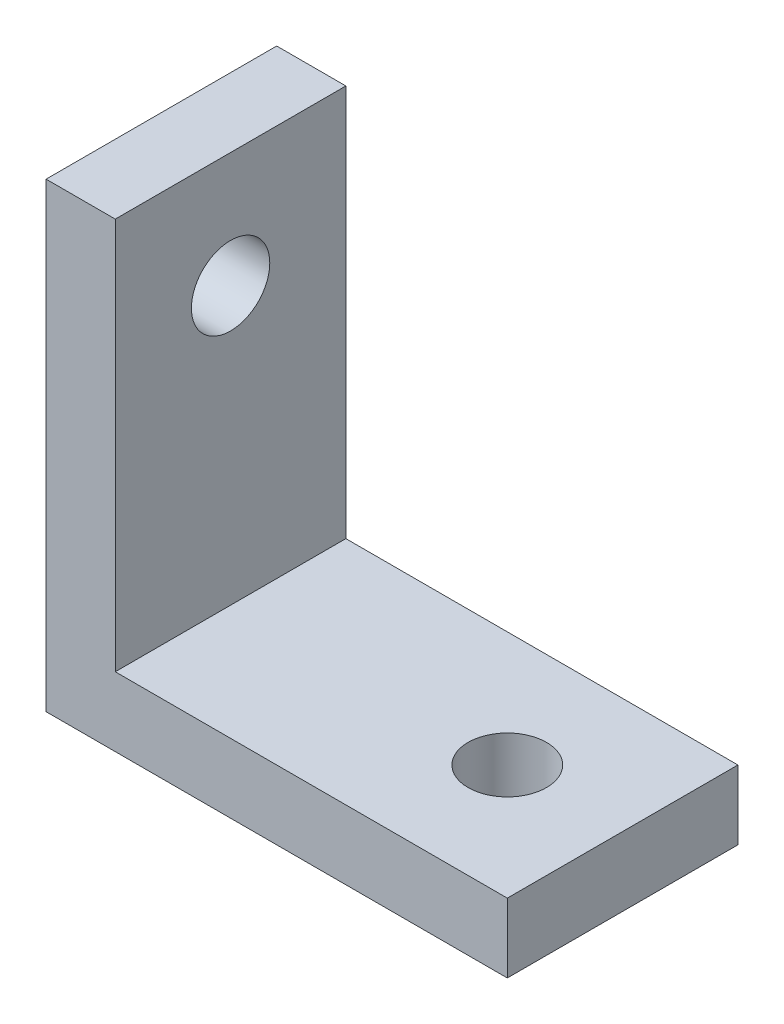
ISO-10303-21;
HEADER;
FILE_DESCRIPTION(('STEP AP214'),'2;1');
FILE_NAME('part.step','',(''),(''),'','','');
FILE_SCHEMA(('AUTOMOTIVE_DESIGN { 1 0 10303 214 1 1 1 1 }'));
ENDSEC;
DATA;
#1=APPLICATION_CONTEXT('core data for automotive mechanical design processes');
#2=APPLICATION_PROTOCOL_DEFINITION('international standard','automotive_design',2000,#1);
#3=PRODUCT_CONTEXT('',#1,'mechanical');
#4=PRODUCT('Part','Part','',(#3));
#5=PRODUCT_RELATED_PRODUCT_CATEGORY('part','',(#4));
#6=PRODUCT_DEFINITION_FORMATION('','',#4);
#7=PRODUCT_DEFINITION_CONTEXT('part definition',#1,'design');
#8=PRODUCT_DEFINITION('design','',#6,#7);
#9=PRODUCT_DEFINITION_SHAPE('','',#8);
#10=(LENGTH_UNIT() NAMED_UNIT(*) SI_UNIT(.MILLI.,.METRE.));
#11=(NAMED_UNIT(*) PLANE_ANGLE_UNIT() SI_UNIT($,.RADIAN.));
#12=(NAMED_UNIT(*) SI_UNIT($,.STERADIAN.) SOLID_ANGLE_UNIT());
#13=UNCERTAINTY_MEASURE_WITH_UNIT(LENGTH_MEASURE(1.E-05),#10,'distance_accuracy_value','');
#14=(GEOMETRIC_REPRESENTATION_CONTEXT(3) GLOBAL_UNCERTAINTY_ASSIGNED_CONTEXT((#13)) GLOBAL_UNIT_ASSIGNED_CONTEXT((#10,
#11,#12)) REPRESENTATION_CONTEXT('',''));
#15=CARTESIAN_POINT('',(0.,0.,0.));
#16=DIRECTION('',(0.,0.,1.));
#17=DIRECTION('',(1.,0.,0.));
#18=AXIS2_PLACEMENT_3D('',#15,#16,#17);
#19=CARTESIAN_POINT('',(10.,10.,10.));
#20=DIRECTION('',(-1.,0.,0.));
#21=DIRECTION('',(0.,-1.,0.));
#22=AXIS2_PLACEMENT_3D('',#19,#20,#21);
#23=PLANE('',#22);
#24=DIRECTION('',(0.,1.,0.));
#25=VECTOR('',#24,1.);
#26=CARTESIAN_POINT('',(10.,10.,0.));
#27=LINE('',#26,#25);
#28=CARTESIAN_POINT('',(10.,-10.,0.));
#29=VERTEX_POINT('',#28);
#30=CARTESIAN_POINT('',(10.,-7.,0.));
#31=VERTEX_POINT('',#30);
#32=EDGE_CURVE('E112',#29,#31,#27,.T.);
#33=ORIENTED_EDGE('',*,*,#32,.T.);
#34=DIRECTION('',(0.,0.,1.));
#35=VECTOR('',#34,1.);
#36=CARTESIAN_POINT('',(10.,-7.,0.));
#37=LINE('',#36,#35);
#38=CARTESIAN_POINT('',(10.,-7.,10.));
#39=VERTEX_POINT('',#38);
#40=EDGE_CURVE('E116',#31,#39,#37,.T.);
#41=ORIENTED_EDGE('',*,*,#40,.T.);
#42=DIRECTION('',(0.,1.,0.));
#43=VECTOR('',#42,1.);
#44=CARTESIAN_POINT('',(10.,10.,10.));
#45=LINE('',#44,#43);
#46=CARTESIAN_POINT('',(10.,-10.,10.));
#47=VERTEX_POINT('',#46);
#48=EDGE_CURVE('E121',#47,#39,#45,.T.);
#49=ORIENTED_EDGE('',*,*,#48,.F.);
#50=DIRECTION('',(0.,0.,-1.));
#51=VECTOR('',#50,1.);
#52=CARTESIAN_POINT('',(10.,-10.,10.));
#53=LINE('',#52,#51);
#54=EDGE_CURVE('E122',#47,#29,#53,.T.);
#55=ORIENTED_EDGE('',*,*,#54,.T.);
#56=EDGE_LOOP('',(#33,#41,#49,#55));
#57=FACE_BOUND('',#56,.T.);
#58=ADVANCED_FACE('F34',(#57),#23,.F.);
#59=CARTESIAN_POINT('',(-10.,10.,10.));
#60=DIRECTION('',(0.,-1.,0.));
#61=DIRECTION('',(0.,0.,-1.));
#62=AXIS2_PLACEMENT_3D('',#59,#60,#61);
#63=PLANE('',#62);
#64=DIRECTION('',(-1.,0.,0.));
#65=VECTOR('',#64,1.);
#66=CARTESIAN_POINT('',(-10.,10.,10.));
#67=LINE('',#66,#65);
#68=CARTESIAN_POINT('',(-7.,10.,10.));
#69=VERTEX_POINT('',#68);
#70=CARTESIAN_POINT('',(-10.,10.,10.));
#71=VERTEX_POINT('',#70);
#72=EDGE_CURVE('E79',#69,#71,#67,.T.);
#73=ORIENTED_EDGE('',*,*,#72,.F.);
#74=DIRECTION('',(0.,0.,1.));
#75=VECTOR('',#74,1.);
#76=CARTESIAN_POINT('',(-7.,10.,0.));
#77=LINE('',#76,#75);
#78=CARTESIAN_POINT('',(-7.,10.,0.));
#79=VERTEX_POINT('',#78);
#80=EDGE_CURVE('E99',#79,#69,#77,.T.);
#81=ORIENTED_EDGE('',*,*,#80,.F.);
#82=DIRECTION('',(-1.,0.,0.));
#83=VECTOR('',#82,1.);
#84=CARTESIAN_POINT('',(-10.,10.,0.));
#85=LINE('',#84,#83);
#86=CARTESIAN_POINT('',(-10.,10.,0.));
#87=VERTEX_POINT('',#86);
#88=EDGE_CURVE('E107',#79,#87,#85,.T.);
#89=ORIENTED_EDGE('',*,*,#88,.T.);
#90=DIRECTION('',(0.,0.,-1.));
#91=VECTOR('',#90,1.);
#92=CARTESIAN_POINT('',(-10.,10.,10.));
#93=LINE('',#92,#91);
#94=EDGE_CURVE('E11',#71,#87,#93,.T.);
#95=ORIENTED_EDGE('',*,*,#94,.F.);
#96=EDGE_LOOP('',(#73,#81,#89,#95));
#97=FACE_BOUND('',#96,.T.);
#98=ADVANCED_FACE('F106',(#97),#63,.F.);
#99=CARTESIAN_POINT('',(-10.,10.,10.));
#100=DIRECTION('',(1.,0.,0.));
#101=DIRECTION('',(0.,1.,0.));
#102=AXIS2_PLACEMENT_3D('',#99,#100,#101);
#103=PLANE('',#102);
#104=CARTESIAN_POINT('',(-10.,5.,5.));
#105=DIRECTION('',(1.,0.,0.));
#106=DIRECTION('',(0.,0.,-1.));
#107=AXIS2_PLACEMENT_3D('',#104,#105,#106);
#108=CIRCLE('',#107,1.7);
#109=CARTESIAN_POINT('',(-10.,5.,3.3));
#110=VERTEX_POINT('',#109);
#111=EDGE_CURVE('E238',#110,#110,#108,.T.);
#112=ORIENTED_EDGE('',*,*,#111,.T.);
#113=EDGE_LOOP('',(#112));
#114=FACE_BOUND('',#113,.T.);
#115=DIRECTION('',(0.,-1.,0.));
#116=VECTOR('',#115,1.);
#117=CARTESIAN_POINT('',(-10.,10.,0.));
#118=LINE('',#117,#116);
#119=CARTESIAN_POINT('',(-10.,-10.,0.));
#120=VERTEX_POINT('',#119);
#121=EDGE_CURVE('E111',#87,#120,#118,.T.);
#122=ORIENTED_EDGE('',*,*,#121,.T.);
#123=DIRECTION('',(0.,0.,-1.));
#124=VECTOR('',#123,1.);
#125=CARTESIAN_POINT('',(-10.,-10.,10.));
#126=LINE('',#125,#124);
#127=CARTESIAN_POINT('',(-10.,-10.,10.));
#128=VERTEX_POINT('',#127);
#129=EDGE_CURVE('E41',#128,#120,#126,.T.);
#130=ORIENTED_EDGE('',*,*,#129,.F.);
#131=DIRECTION('',(0.,-1.,0.));
#132=VECTOR('',#131,1.);
#133=CARTESIAN_POINT('',(-10.,10.,10.));
#134=LINE('',#133,#132);
#135=EDGE_CURVE('E133',#71,#128,#134,.T.);
#136=ORIENTED_EDGE('',*,*,#135,.F.);
#137=ORIENTED_EDGE('',*,*,#94,.T.);
#138=EDGE_LOOP('',(#122,#130,#136,#137));
#139=FACE_BOUND('',#138,.T.);
#140=ADVANCED_FACE('F138',(#114,#139),#103,.F.);
#141=CARTESIAN_POINT('',(-10.,-10.,10.));
#142=DIRECTION('',(0.,1.,0.));
#143=DIRECTION('',(0.,0.,1.));
#144=AXIS2_PLACEMENT_3D('',#141,#142,#143);
#145=PLANE('',#144);
#146=CARTESIAN_POINT('',(5.,-10.,5.));
#147=DIRECTION('',(0.,1.,0.));
#148=DIRECTION('',(0.,0.,1.));
#149=AXIS2_PLACEMENT_3D('',#146,#147,#148);
#150=CIRCLE('',#149,1.7);
#151=CARTESIAN_POINT('',(5.,-10.,6.7));
#152=VERTEX_POINT('',#151);
#153=EDGE_CURVE('E228',#152,#152,#150,.T.);
#154=ORIENTED_EDGE('',*,*,#153,.T.);
#155=EDGE_LOOP('',(#154));
#156=FACE_BOUND('',#155,.T.);
#157=DIRECTION('',(1.,0.,0.));
#158=VECTOR('',#157,1.);
#159=CARTESIAN_POINT('',(-10.,-10.,0.));
#160=LINE('',#159,#158);
#161=EDGE_CURVE('E74',#120,#29,#160,.T.);
#162=ORIENTED_EDGE('',*,*,#161,.T.);
#163=ORIENTED_EDGE('',*,*,#54,.F.);
#164=DIRECTION('',(1.,0.,0.));
#165=VECTOR('',#164,1.);
#166=CARTESIAN_POINT('',(-10.,-10.,10.));
#167=LINE('',#166,#165);
#168=EDGE_CURVE('E57',#128,#47,#167,.T.);
#169=ORIENTED_EDGE('',*,*,#168,.F.);
#170=ORIENTED_EDGE('',*,*,#129,.T.);
#171=EDGE_LOOP('',(#162,#163,#169,#170));
#172=FACE_BOUND('',#171,.T.);
#173=ADVANCED_FACE('F124',(#156,#172),#145,.F.);
#174=CARTESIAN_POINT('',(0.,0.,10.));
#175=DIRECTION('',(0.,0.,1.));
#176=DIRECTION('',(1.,0.,0.));
#177=AXIS2_PLACEMENT_3D('',#174,#175,#176);
#178=PLANE('',#177);
#179=DIRECTION('',(1.,0.,0.));
#180=VECTOR('',#179,1.);
#181=CARTESIAN_POINT('',(10.,-7.,10.));
#182=LINE('',#181,#180);
#183=CARTESIAN_POINT('',(-7.,-7.,10.));
#184=VERTEX_POINT('',#183);
#185=EDGE_CURVE('E103',#184,#39,#182,.T.);
#186=ORIENTED_EDGE('',*,*,#185,.F.);
#187=DIRECTION('',(0.,-1.,0.));
#188=VECTOR('',#187,1.);
#189=CARTESIAN_POINT('',(-7.,10.,10.));
#190=LINE('',#189,#188);
#191=EDGE_CURVE('E239',#69,#184,#190,.T.);
#192=ORIENTED_EDGE('',*,*,#191,.F.);
#193=ORIENTED_EDGE('',*,*,#72,.T.);
#194=ORIENTED_EDGE('',*,*,#135,.T.);
#195=ORIENTED_EDGE('',*,*,#168,.T.);
#196=ORIENTED_EDGE('',*,*,#48,.T.);
#197=EDGE_LOOP('',(#186,#192,#193,#194,#195,#196));
#198=FACE_BOUND('',#197,.T.);
#199=ADVANCED_FACE('F137',(#198),#178,.T.);
#200=CARTESIAN_POINT('',(0.,0.,0.));
#201=DIRECTION('',(0.,0.,1.));
#202=DIRECTION('',(1.,0.,0.));
#203=AXIS2_PLACEMENT_3D('',#200,#201,#202);
#204=PLANE('',#203);
#205=DIRECTION('',(0.,-1.,0.));
#206=VECTOR('',#205,1.);
#207=CARTESIAN_POINT('',(-7.,10.,0.));
#208=LINE('',#207,#206);
#209=CARTESIAN_POINT('',(-7.,-7.,0.));
#210=VERTEX_POINT('',#209);
#211=EDGE_CURVE('E95',#79,#210,#208,.T.);
#212=ORIENTED_EDGE('',*,*,#211,.T.);
#213=DIRECTION('',(1.,0.,0.));
#214=VECTOR('',#213,1.);
#215=CARTESIAN_POINT('',(10.,-7.,0.));
#216=LINE('',#215,#214);
#217=EDGE_CURVE('E48',#210,#31,#216,.T.);
#218=ORIENTED_EDGE('',*,*,#217,.T.);
#219=ORIENTED_EDGE('',*,*,#32,.F.);
#220=ORIENTED_EDGE('',*,*,#161,.F.);
#221=ORIENTED_EDGE('',*,*,#121,.F.);
#222=ORIENTED_EDGE('',*,*,#88,.F.);
#223=EDGE_LOOP('',(#212,#218,#219,#220,#221,#222));
#224=FACE_BOUND('',#223,.T.);
#225=ADVANCED_FACE('F110',(#224),#204,.F.);
#226=CARTESIAN_POINT('',(10.,-7.,0.));
#227=DIRECTION('',(0.,-1.,0.));
#228=DIRECTION('',(0.,0.,-1.));
#229=AXIS2_PLACEMENT_3D('',#226,#227,#228);
#230=PLANE('',#229);
#231=CARTESIAN_POINT('',(5.,-7.,5.));
#232=DIRECTION('',(0.,1.,0.));
#233=DIRECTION('',(0.,0.,1.));
#234=AXIS2_PLACEMENT_3D('',#231,#232,#233);
#235=CIRCLE('',#234,1.69999999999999);
#236=CARTESIAN_POINT('',(5.,-7.,6.69999999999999));
#237=VERTEX_POINT('',#236);
#238=EDGE_CURVE('E231',#237,#237,#235,.T.);
#239=ORIENTED_EDGE('',*,*,#238,.F.);
#240=EDGE_LOOP('',(#239));
#241=FACE_BOUND('',#240,.T.);
#242=ORIENTED_EDGE('',*,*,#185,.T.);
#243=ORIENTED_EDGE('',*,*,#40,.F.);
#244=ORIENTED_EDGE('',*,*,#217,.F.);
#245=DIRECTION('',(0.,0.,1.));
#246=VECTOR('',#245,1.);
#247=CARTESIAN_POINT('',(-7.,-7.,0.));
#248=LINE('',#247,#246);
#249=EDGE_CURVE('E100',#210,#184,#248,.T.);
#250=ORIENTED_EDGE('',*,*,#249,.T.);
#251=EDGE_LOOP('',(#242,#243,#244,#250));
#252=FACE_BOUND('',#251,.T.);
#253=ADVANCED_FACE('F174',(#241,#252),#230,.F.);
#254=CARTESIAN_POINT('',(-7.,10.,0.));
#255=DIRECTION('',(-1.,0.,0.));
#256=DIRECTION('',(0.,-1.,0.));
#257=AXIS2_PLACEMENT_3D('',#254,#255,#256);
#258=PLANE('',#257);
#259=CARTESIAN_POINT('',(-7.,5.,5.));
#260=DIRECTION('',(1.,0.,0.));
#261=DIRECTION('',(0.,0.,-1.));
#262=AXIS2_PLACEMENT_3D('',#259,#260,#261);
#263=CIRCLE('',#262,1.69999999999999);
#264=CARTESIAN_POINT('',(-7.,5.,3.30000000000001));
#265=VERTEX_POINT('',#264);
#266=EDGE_CURVE('E233',#265,#265,#263,.T.);
#267=ORIENTED_EDGE('',*,*,#266,.F.);
#268=EDGE_LOOP('',(#267));
#269=FACE_BOUND('',#268,.T.);
#270=ORIENTED_EDGE('',*,*,#191,.T.);
#271=ORIENTED_EDGE('',*,*,#249,.F.);
#272=ORIENTED_EDGE('',*,*,#211,.F.);
#273=ORIENTED_EDGE('',*,*,#80,.T.);
#274=EDGE_LOOP('',(#270,#271,#272,#273));
#275=FACE_BOUND('',#274,.T.);
#276=ADVANCED_FACE('F98',(#269,#275),#258,.F.);
#277=CARTESIAN_POINT('',(-7.,5.,5.));
#278=DIRECTION('',(1.,0.,0.));
#279=DIRECTION('',(0.,0.,-1.));
#280=AXIS2_PLACEMENT_3D('',#277,#278,#279);
#281=CYLINDRICAL_SURFACE('',#280,1.69999999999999);
#282=ORIENTED_EDGE('',*,*,#111,.F.);
#283=EDGE_LOOP('',(#282));
#284=FACE_BOUND('',#283,.T.);
#285=ORIENTED_EDGE('',*,*,#266,.T.);
#286=EDGE_LOOP('',(#285));
#287=FACE_BOUND('',#286,.T.);
#288=ADVANCED_FACE('F189',(#284,#287),#281,.F.);
#289=CARTESIAN_POINT('',(5.,-7.,5.));
#290=DIRECTION('',(0.,1.,0.));
#291=DIRECTION('',(0.,0.,1.));
#292=AXIS2_PLACEMENT_3D('',#289,#290,#291);
#293=CYLINDRICAL_SURFACE('',#292,1.69999999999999);
#294=ORIENTED_EDGE('',*,*,#153,.F.);
#295=EDGE_LOOP('',(#294));
#296=FACE_BOUND('',#295,.T.);
#297=ORIENTED_EDGE('',*,*,#238,.T.);
#298=EDGE_LOOP('',(#297));
#299=FACE_BOUND('',#298,.T.);
#300=ADVANCED_FACE('F199',(#296,#299),#293,.F.);
#301=CLOSED_SHELL('',(#58,#98,#140,#173,#199,#225,#253,#276,#288,#300));
#302=MANIFOLD_SOLID_BREP('B2',#301);
#303=ADVANCED_BREP_SHAPE_REPRESENTATION('',(#18,#302),#14);
#304=SHAPE_DEFINITION_REPRESENTATION(#9,#303);
ENDSEC;
END-ISO-10303-21;
